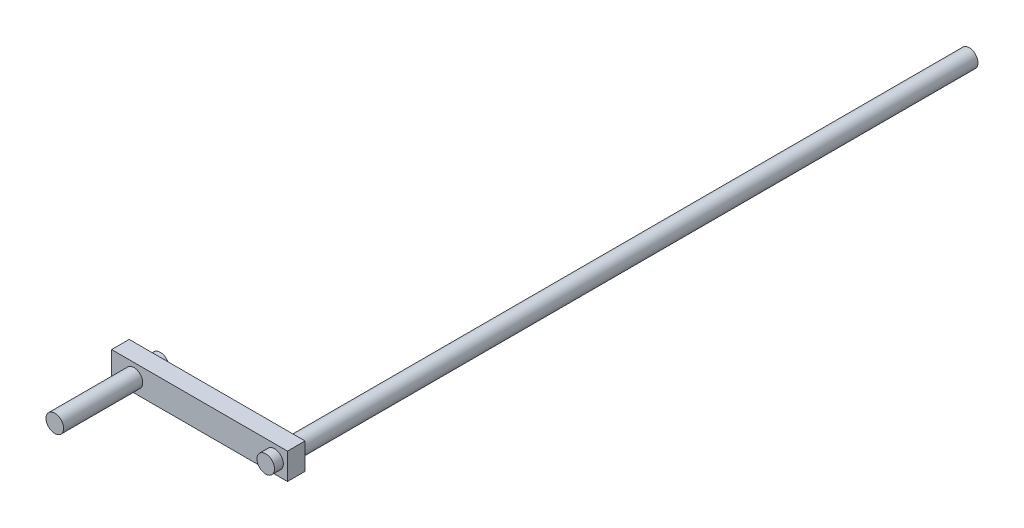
ISO-10303-21;
HEADER;
FILE_DESCRIPTION(('STEP AP214'),'2;1');
FILE_NAME('part.step','',(''),(''),'','','');
FILE_SCHEMA(('AUTOMOTIVE_DESIGN { 1 0 10303 214 1 1 1 1 }'));
ENDSEC;
DATA;
#1=APPLICATION_CONTEXT('core data for automotive mechanical design processes');
#2=APPLICATION_PROTOCOL_DEFINITION('international standard','automotive_design',2000,#1);
#3=PRODUCT_CONTEXT('',#1,'mechanical');
#4=PRODUCT('Part','Part','',(#3));
#5=PRODUCT_RELATED_PRODUCT_CATEGORY('part','',(#4));
#6=PRODUCT_DEFINITION_FORMATION('','',#4);
#7=PRODUCT_DEFINITION_CONTEXT('part definition',#1,'design');
#8=PRODUCT_DEFINITION('design','',#6,#7);
#9=PRODUCT_DEFINITION_SHAPE('','',#8);
#10=(LENGTH_UNIT() NAMED_UNIT(*) SI_UNIT(.MILLI.,.METRE.));
#11=(NAMED_UNIT(*) PLANE_ANGLE_UNIT() SI_UNIT($,.RADIAN.));
#12=(NAMED_UNIT(*) SI_UNIT($,.STERADIAN.) SOLID_ANGLE_UNIT());
#13=UNCERTAINTY_MEASURE_WITH_UNIT(LENGTH_MEASURE(1.E-05),#10,'distance_accuracy_value','');
#14=(GEOMETRIC_REPRESENTATION_CONTEXT(3) GLOBAL_UNCERTAINTY_ASSIGNED_CONTEXT((#13)) GLOBAL_UNIT_ASSIGNED_CONTEXT((#10,
#11,#12)) REPRESENTATION_CONTEXT('',''));
#15=CARTESIAN_POINT('',(0.,0.,0.));
#16=DIRECTION('',(0.,0.,1.));
#17=DIRECTION('',(1.,0.,0.));
#18=AXIS2_PLACEMENT_3D('',#15,#16,#17);
#19=CARTESIAN_POINT('',(0.,0.,80.));
#20=DIRECTION('',(0.,0.,-1.));
#21=DIRECTION('',(-1.,0.,0.));
#22=AXIS2_PLACEMENT_3D('',#19,#20,#21);
#23=CYLINDRICAL_SURFACE('',#22,1.);
#24=CARTESIAN_POINT('',(0.,0.,0.));
#25=DIRECTION('',(0.,0.,1.));
#26=DIRECTION('',(1.,0.,0.));
#27=AXIS2_PLACEMENT_3D('',#24,#25,#26);
#28=CIRCLE('',#27,1.);
#29=CARTESIAN_POINT('',(1.,0.,0.));
#30=VERTEX_POINT('',#29);
#31=EDGE_CURVE('E120',#30,#30,#28,.T.);
#32=ORIENTED_EDGE('',*,*,#31,.T.);
#33=EDGE_LOOP('',(#32));
#34=FACE_BOUND('',#33,.T.);
#35=CARTESIAN_POINT('',(0.,0.,77.));
#36=DIRECTION('',(0.,0.,1.));
#37=DIRECTION('',(1.,0.,0.));
#38=AXIS2_PLACEMENT_3D('',#35,#36,#37);
#39=CIRCLE('',#38,1.);
#40=CARTESIAN_POINT('',(1.,0.,77.));
#41=VERTEX_POINT('',#40);
#42=EDGE_CURVE('E43',#41,#41,#39,.T.);
#43=ORIENTED_EDGE('',*,*,#42,.F.);
#44=EDGE_LOOP('',(#43));
#45=FACE_BOUND('',#44,.T.);
#46=ADVANCED_FACE('F34',(#34,#45),#23,.T.);
#47=CARTESIAN_POINT('',(0.,0.,0.));
#48=DIRECTION('',(0.,0.,1.));
#49=DIRECTION('',(1.,0.,0.));
#50=AXIS2_PLACEMENT_3D('',#47,#48,#49);
#51=PLANE('',#50);
#52=ORIENTED_EDGE('',*,*,#31,.F.);
#53=EDGE_LOOP('',(#52));
#54=FACE_BOUND('',#53,.T.);
#55=ADVANCED_FACE('F128',(#54),#51,.F.);
#56=CARTESIAN_POINT('',(-18.5288274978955,-1.5,77.));
#57=DIRECTION('',(0.,0.,1.));
#58=DIRECTION('',(1.,0.,0.));
#59=AXIS2_PLACEMENT_3D('',#56,#57,#58);
#60=PLANE('',#59);
#61=CARTESIAN_POINT('',(-15.9889424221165,0.,77.));
#62=DIRECTION('',(0.,0.,1.));
#63=DIRECTION('',(1.,0.,0.));
#64=AXIS2_PLACEMENT_3D('',#61,#62,#63);
#65=CIRCLE('',#64,1.);
#66=CARTESIAN_POINT('',(-14.9889424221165,0.,77.));
#67=VERTEX_POINT('',#66);
#68=EDGE_CURVE('E108',#67,#67,#65,.T.);
#69=ORIENTED_EDGE('',*,*,#68,.T.);
#70=EDGE_LOOP('',(#69));
#71=FACE_BOUND('',#70,.T.);
#72=DIRECTION('',(0.,-1.,0.));
#73=VECTOR('',#72,1.);
#74=CARTESIAN_POINT('',(-18.5288274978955,1.5,77.));
#75=LINE('',#74,#73);
#76=CARTESIAN_POINT('',(-18.5288274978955,1.5,77.));
#77=VERTEX_POINT('',#76);
#78=CARTESIAN_POINT('',(-18.5288274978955,-1.5,77.));
#79=VERTEX_POINT('',#78);
#80=EDGE_CURVE('E97',#77,#79,#75,.T.);
#81=ORIENTED_EDGE('',*,*,#80,.F.);
#82=DIRECTION('',(-1.,0.,0.));
#83=VECTOR('',#82,1.);
#84=CARTESIAN_POINT('',(-18.5288274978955,1.5,77.));
#85=LINE('',#84,#83);
#86=CARTESIAN_POINT('',(1.47117250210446,1.5,77.));
#87=VERTEX_POINT('',#86);
#88=EDGE_CURVE('E94',#87,#77,#85,.T.);
#89=ORIENTED_EDGE('',*,*,#88,.F.);
#90=DIRECTION('',(0.,1.,0.));
#91=VECTOR('',#90,1.);
#92=CARTESIAN_POINT('',(1.47117250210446,1.5,77.));
#93=LINE('',#92,#91);
#94=CARTESIAN_POINT('',(1.47117250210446,-1.5,77.));
#95=VERTEX_POINT('',#94);
#96=EDGE_CURVE('E85',#95,#87,#93,.T.);
#97=ORIENTED_EDGE('',*,*,#96,.F.);
#98=DIRECTION('',(1.,0.,0.));
#99=VECTOR('',#98,1.);
#100=CARTESIAN_POINT('',(-18.5288274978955,-1.5,77.));
#101=LINE('',#100,#99);
#102=EDGE_CURVE('E93',#79,#95,#101,.T.);
#103=ORIENTED_EDGE('',*,*,#102,.F.);
#104=EDGE_LOOP('',(#81,#89,#97,#103));
#105=FACE_BOUND('',#104,.T.);
#106=ORIENTED_EDGE('',*,*,#42,.T.);
#107=EDGE_LOOP('',(#106));
#108=FACE_BOUND('',#107,.T.);
#109=ADVANCED_FACE('F91',(#71,#105,#108),#60,.F.);
#110=CARTESIAN_POINT('',(-18.5288274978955,-1.5,79.));
#111=DIRECTION('',(0.,0.,1.));
#112=DIRECTION('',(1.,0.,0.));
#113=AXIS2_PLACEMENT_3D('',#110,#111,#112);
#114=PLANE('',#113);
#115=CARTESIAN_POINT('',(-15.9889424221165,0.,79.));
#116=DIRECTION('',(0.,0.,1.));
#117=DIRECTION('',(1.,0.,0.));
#118=AXIS2_PLACEMENT_3D('',#115,#116,#117);
#119=CIRCLE('',#118,1.);
#120=CARTESIAN_POINT('',(-14.9889424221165,0.,79.));
#121=VERTEX_POINT('',#120);
#122=EDGE_CURVE('E11',#121,#121,#119,.T.);
#123=ORIENTED_EDGE('',*,*,#122,.F.);
#124=EDGE_LOOP('',(#123));
#125=FACE_BOUND('',#124,.T.);
#126=DIRECTION('',(0.,-1.,0.));
#127=VECTOR('',#126,1.);
#128=CARTESIAN_POINT('',(-18.5288274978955,1.5,79.));
#129=LINE('',#128,#127);
#130=CARTESIAN_POINT('',(-18.5288274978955,1.5,79.));
#131=VERTEX_POINT('',#130);
#132=CARTESIAN_POINT('',(-18.5288274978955,-1.5,79.));
#133=VERTEX_POINT('',#132);
#134=EDGE_CURVE('E104',#131,#133,#129,.T.);
#135=ORIENTED_EDGE('',*,*,#134,.T.);
#136=DIRECTION('',(1.,0.,0.));
#137=VECTOR('',#136,1.);
#138=CARTESIAN_POINT('',(-18.5288274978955,-1.5,79.));
#139=LINE('',#138,#137);
#140=CARTESIAN_POINT('',(1.47117250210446,-1.5,79.));
#141=VERTEX_POINT('',#140);
#142=EDGE_CURVE('E107',#133,#141,#139,.T.);
#143=ORIENTED_EDGE('',*,*,#142,.T.);
#144=DIRECTION('',(0.,1.,0.));
#145=VECTOR('',#144,1.);
#146=CARTESIAN_POINT('',(1.47117250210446,1.5,79.));
#147=LINE('',#146,#145);
#148=CARTESIAN_POINT('',(1.47117250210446,1.5,79.));
#149=VERTEX_POINT('',#148);
#150=EDGE_CURVE('E87',#141,#149,#147,.T.);
#151=ORIENTED_EDGE('',*,*,#150,.T.);
#152=DIRECTION('',(-1.,0.,0.));
#153=VECTOR('',#152,1.);
#154=CARTESIAN_POINT('',(-18.5288274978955,1.5,79.));
#155=LINE('',#154,#153);
#156=EDGE_CURVE('E99',#149,#131,#155,.T.);
#157=ORIENTED_EDGE('',*,*,#156,.T.);
#158=EDGE_LOOP('',(#135,#143,#151,#157));
#159=FACE_BOUND('',#158,.T.);
#160=CARTESIAN_POINT('',(0.,0.,79.));
#161=DIRECTION('',(0.,0.,1.));
#162=DIRECTION('',(1.,0.,0.));
#163=AXIS2_PLACEMENT_3D('',#160,#161,#162);
#164=CIRCLE('',#163,1.);
#165=CARTESIAN_POINT('',(1.,0.,79.));
#166=VERTEX_POINT('',#165);
#167=EDGE_CURVE('E114',#166,#166,#164,.T.);
#168=ORIENTED_EDGE('',*,*,#167,.F.);
#169=EDGE_LOOP('',(#168));
#170=FACE_BOUND('',#169,.T.);
#171=ADVANCED_FACE('F151',(#125,#159,#170),#114,.T.);
#172=CARTESIAN_POINT('',(-18.5288274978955,1.5,77.));
#173=DIRECTION('',(-1.,0.,0.));
#174=DIRECTION('',(0.,0.,1.));
#175=AXIS2_PLACEMENT_3D('',#172,#173,#174);
#176=PLANE('',#175);
#177=ORIENTED_EDGE('',*,*,#134,.F.);
#178=DIRECTION('',(0.,0.,1.));
#179=VECTOR('',#178,1.);
#180=CARTESIAN_POINT('',(-18.5288274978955,1.5,77.));
#181=LINE('',#180,#179);
#182=EDGE_CURVE('E51',#77,#131,#181,.T.);
#183=ORIENTED_EDGE('',*,*,#182,.F.);
#184=ORIENTED_EDGE('',*,*,#80,.T.);
#185=DIRECTION('',(0.,0.,1.));
#186=VECTOR('',#185,1.);
#187=CARTESIAN_POINT('',(-18.5288274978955,-1.5,77.));
#188=LINE('',#187,#186);
#189=EDGE_CURVE('E79',#79,#133,#188,.T.);
#190=ORIENTED_EDGE('',*,*,#189,.T.);
#191=EDGE_LOOP('',(#177,#183,#184,#190));
#192=FACE_BOUND('',#191,.T.);
#193=ADVANCED_FACE('F153',(#192),#176,.T.);
#194=CARTESIAN_POINT('',(-18.5288274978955,1.5,77.));
#195=DIRECTION('',(0.,1.,0.));
#196=DIRECTION('',(-1.,0.,0.));
#197=AXIS2_PLACEMENT_3D('',#194,#195,#196);
#198=PLANE('',#197);
#199=ORIENTED_EDGE('',*,*,#156,.F.);
#200=DIRECTION('',(0.,0.,1.));
#201=VECTOR('',#200,1.);
#202=CARTESIAN_POINT('',(1.47117250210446,1.5,77.));
#203=LINE('',#202,#201);
#204=EDGE_CURVE('E68',#87,#149,#203,.T.);
#205=ORIENTED_EDGE('',*,*,#204,.F.);
#206=ORIENTED_EDGE('',*,*,#88,.T.);
#207=ORIENTED_EDGE('',*,*,#182,.T.);
#208=EDGE_LOOP('',(#199,#205,#206,#207));
#209=FACE_BOUND('',#208,.T.);
#210=ADVANCED_FACE('F160',(#209),#198,.T.);
#211=CARTESIAN_POINT('',(1.47117250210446,1.5,77.));
#212=DIRECTION('',(1.,0.,0.));
#213=DIRECTION('',(0.,1.,0.));
#214=AXIS2_PLACEMENT_3D('',#211,#212,#213);
#215=PLANE('',#214);
#216=ORIENTED_EDGE('',*,*,#150,.F.);
#217=DIRECTION('',(0.,0.,1.));
#218=VECTOR('',#217,1.);
#219=CARTESIAN_POINT('',(1.47117250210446,-1.5,77.));
#220=LINE('',#219,#218);
#221=EDGE_CURVE('E82',#95,#141,#220,.T.);
#222=ORIENTED_EDGE('',*,*,#221,.F.);
#223=ORIENTED_EDGE('',*,*,#96,.T.);
#224=ORIENTED_EDGE('',*,*,#204,.T.);
#225=EDGE_LOOP('',(#216,#222,#223,#224));
#226=FACE_BOUND('',#225,.T.);
#227=ADVANCED_FACE('F84',(#226),#215,.T.);
#228=CARTESIAN_POINT('',(-18.5288274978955,-1.5,77.));
#229=DIRECTION('',(0.,-1.,0.));
#230=DIRECTION('',(1.,0.,0.));
#231=AXIS2_PLACEMENT_3D('',#228,#229,#230);
#232=PLANE('',#231);
#233=ORIENTED_EDGE('',*,*,#142,.F.);
#234=ORIENTED_EDGE('',*,*,#189,.F.);
#235=ORIENTED_EDGE('',*,*,#102,.T.);
#236=ORIENTED_EDGE('',*,*,#221,.T.);
#237=EDGE_LOOP('',(#233,#234,#235,#236));
#238=FACE_BOUND('',#237,.T.);
#239=ADVANCED_FACE('F96',(#238),#232,.T.);
#240=CARTESIAN_POINT('',(0.,0.,80.));
#241=DIRECTION('',(0.,0.,1.));
#242=DIRECTION('',(1.,0.,0.));
#243=AXIS2_PLACEMENT_3D('',#240,#241,#242);
#244=PLANE('',#243);
#245=CARTESIAN_POINT('',(0.,0.,80.));
#246=DIRECTION('',(0.,0.,1.));
#247=DIRECTION('',(1.,0.,0.));
#248=AXIS2_PLACEMENT_3D('',#245,#246,#247);
#249=CIRCLE('',#248,1.);
#250=CARTESIAN_POINT('',(1.,0.,80.));
#251=VERTEX_POINT('',#250);
#252=EDGE_CURVE('E117',#251,#251,#249,.T.);
#253=ORIENTED_EDGE('',*,*,#252,.T.);
#254=EDGE_LOOP('',(#253));
#255=FACE_BOUND('',#254,.T.);
#256=ADVANCED_FACE('F136',(#255),#244,.T.);
#257=ORIENTED_EDGE('',*,*,#167,.T.);
#258=EDGE_LOOP('',(#257));
#259=FACE_BOUND('',#258,.T.);
#260=ORIENTED_EDGE('',*,*,#252,.F.);
#261=EDGE_LOOP('',(#260));
#262=FACE_BOUND('',#261,.T.);
#263=ADVANCED_FACE('F36',(#259,#262),#23,.T.);
#264=CARTESIAN_POINT('',(-15.9889424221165,0.,88.));
#265=DIRECTION('',(0.,0.,-1.));
#266=DIRECTION('',(-1.,0.,0.));
#267=AXIS2_PLACEMENT_3D('',#264,#265,#266);
#268=PLANE('',#267);
#269=CARTESIAN_POINT('',(-15.9889424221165,0.,88.));
#270=DIRECTION('',(0.,0.,-1.));
#271=DIRECTION('',(-1.,0.,0.));
#272=AXIS2_PLACEMENT_3D('',#269,#270,#271);
#273=CIRCLE('',#272,1.);
#274=CARTESIAN_POINT('',(-16.9889424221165,0.,88.));
#275=VERTEX_POINT('',#274);
#276=EDGE_CURVE('E252',#275,#275,#273,.T.);
#277=ORIENTED_EDGE('',*,*,#276,.F.);
#278=EDGE_LOOP('',(#277));
#279=FACE_BOUND('',#278,.T.);
#280=ADVANCED_FACE('F135',(#279),#268,.F.);
#281=CARTESIAN_POINT('',(-15.9889424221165,0.,88.));
#282=DIRECTION('',(0.,0.,-1.));
#283=DIRECTION('',(-1.,0.,0.));
#284=AXIS2_PLACEMENT_3D('',#281,#282,#283);
#285=CYLINDRICAL_SURFACE('',#284,1.);
#286=ORIENTED_EDGE('',*,*,#122,.T.);
#287=EDGE_LOOP('',(#286));
#288=FACE_BOUND('',#287,.T.);
#289=ORIENTED_EDGE('',*,*,#276,.T.);
#290=EDGE_LOOP('',(#289));
#291=FACE_BOUND('',#290,.T.);
#292=ADVANCED_FACE('F142',(#288,#291),#285,.T.);
#293=CARTESIAN_POINT('',(-15.9889424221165,0.,76.));
#294=DIRECTION('',(0.,0.,-1.));
#295=DIRECTION('',(-1.,0.,0.));
#296=AXIS2_PLACEMENT_3D('',#293,#294,#295);
#297=CIRCLE('',#296,1.);
#298=CARTESIAN_POINT('',(-16.9889424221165,0.,76.));
#299=VERTEX_POINT('',#298);
#300=EDGE_CURVE('E251',#299,#299,#297,.T.);
#301=ORIENTED_EDGE('',*,*,#300,.F.);
#302=EDGE_LOOP('',(#301));
#303=FACE_BOUND('',#302,.T.);
#304=ORIENTED_EDGE('',*,*,#68,.F.);
#305=EDGE_LOOP('',(#304));
#306=FACE_BOUND('',#305,.T.);
#307=ADVANCED_FACE('F227',(#303,#306),#285,.T.);
#308=CARTESIAN_POINT('',(-15.9889424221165,0.,76.));
#309=DIRECTION('',(0.,0.,-1.));
#310=DIRECTION('',(-1.,0.,0.));
#311=AXIS2_PLACEMENT_3D('',#308,#309,#310);
#312=PLANE('',#311);
#313=ORIENTED_EDGE('',*,*,#300,.T.);
#314=EDGE_LOOP('',(#313));
#315=FACE_BOUND('',#314,.T.);
#316=ADVANCED_FACE('F235',(#315),#312,.T.);
#317=CLOSED_SHELL('',(#46,#55,#109,#171,#193,#210,#227,#239,#256,#263,#280,#292,#307,#316));
#318=MANIFOLD_SOLID_BREP('B2',#317);
#319=ADVANCED_BREP_SHAPE_REPRESENTATION('',(#18,#318),#14);
#320=SHAPE_DEFINITION_REPRESENTATION(#9,#319);
ENDSEC;
END-ISO-10303-21;
